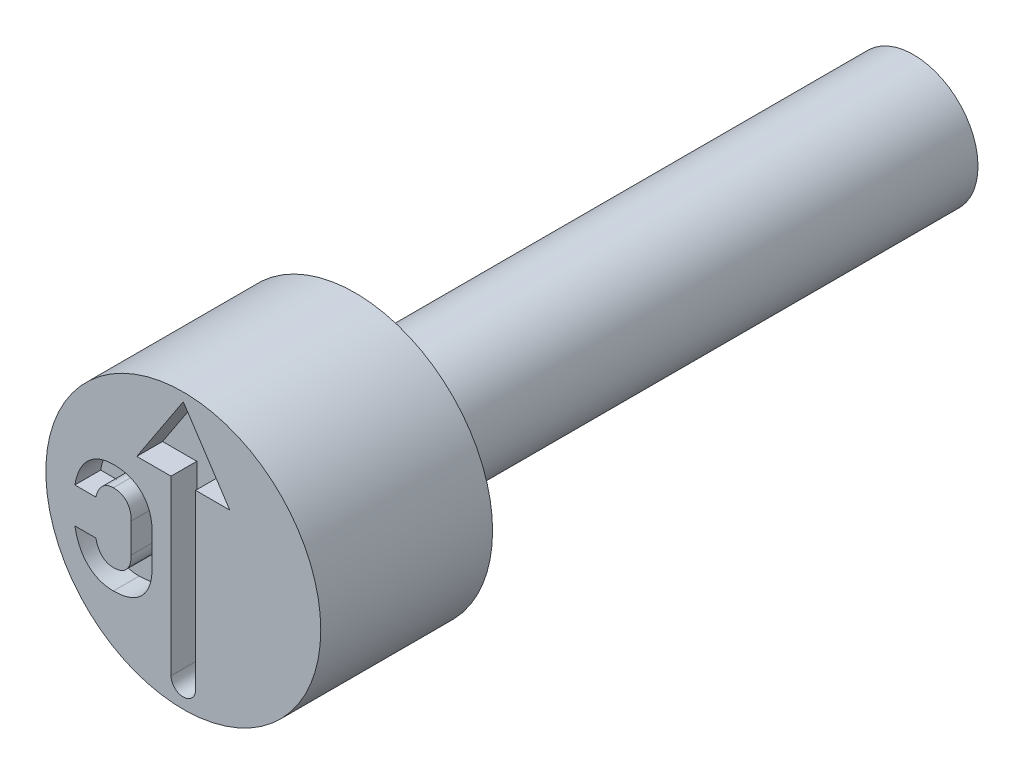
from build123d import *

# Parameters (mm, degrees)
CUT_EXTRUDE4_DEPTH = 0.6
CUT_EXTRUDE5_DEPTH = 0.6


with BuildPart() as part:
    # Sketch2 → Revolve1 (revolve)
    with BuildSketch(Plane(origin=(0, 0, 0), x_dir=(0, 0, -1), z_dir=(1, 0, 0)), mode=Mode.PRIVATE) as revolve1_sk:
        Polygon((0, 3.2), (0, 0), (17, 0), (17, 1.5), (4, 1.5), (4, 3.2), align=None)
    revolve(revolve1_sk.sketch.rotate(Axis((0, 0, -0.403888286), (0, 0, -1)), 90), axis=Axis((0, 0, -0.403888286), (0, 0, -1)))

    # Sketch3 → Cut-Extrude4 (cut)
    with BuildSketch(Plane.XY):
        with BuildLine():
            Line((0.285709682, 1.359527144), (0.285709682, -2.664242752))
            ThreePointArc((0.285709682, -2.664242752), (0, -2.949952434), (-0.285709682, -2.664242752))
            Line((-0.285709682, -2.664242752), (-0.285709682, 1.359527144))
            Line((-0.285709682, 1.359527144), (-1.082876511, 1.359527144))
            Line((-1.082876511, 1.359527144), (0, 3.00317302))
            Line((0, 3.00317302), (1.082876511, 1.359527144))
            Line((1.082876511, 1.359527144), (0.285709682, 1.359527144))
        make_face()
    extrude(amount=-CUT_EXTRUDE4_DEPTH, mode=Mode.SUBTRACT)

    # Sketch4 → Cut-Extrude5 (cut)
    with BuildSketch(Plane.XY):
        with BuildLine():
            add(Edge.make_bspline(
                [(-1.627980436, -1.625983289), (-1.604705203, -1.625731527), (-1.558775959, -1.625234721), (-1.491240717, -1.620065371), (-1.426085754, -1.611424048), (-1.363666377, -1.599238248), (-1.303810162, -1.583865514), (-1.246260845, -1.565695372), (-1.191572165, -1.543201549), (-1.139213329, -1.517693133), (-1.089921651, -1.488821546), (-1.043801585, -1.456347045), (-1.000395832, -1.421288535), (-0.960033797, -1.382943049), (-0.922757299, -1.341534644), (-0.888354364, -1.297017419), (-0.857531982, -1.249107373), (-0.829335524, -1.198450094), (-0.804249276, -1.144907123), (-0.783076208, -1.08822291), (-0.764719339, -1.02902337), (-0.749363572, -0.967317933), (-0.7376066, -0.902826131), (-0.729769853, -0.835596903), (-0.724337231, -0.765566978), (-0.723888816, -0.71793769), (-0.723660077, -0.693641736)],
                knots=[0, 0, 0, 0, 1.134237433, 2.238201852, 3.298772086, 4.336057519, 5.335809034, 6.309558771, 7.274828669, 8.21507465, 9.146315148, 10.055631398, 10.961815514, 11.863452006, 12.765999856, 13.674901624, 14.60241943, 15.539819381, 16.498894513, 17.481225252, 18.486546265, 19.518401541, 20.578551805, 21.679128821, 22.816111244, 24, 24, 24, 24], degree=3))
            Line((-0.723660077, -0.693641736), (-0.723660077, -0.007886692))
            add(Edge.make_bspline(
                [(-0.723660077, -0.007886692), (-0.723888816, 0.016409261), (-0.724337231, 0.064038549), (-0.729769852, 0.134068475), (-0.737606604, 0.201297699), (-0.74936356, 0.265789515), (-0.764719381, 0.327494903), (-0.783076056, 0.386694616), (-0.804249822, 0.443378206), (-0.829333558, 0.496923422), (-0.857539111, 0.547572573), (-0.888328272, 0.59551231), (-0.922929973, 0.640021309), (-0.959852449, 0.681916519), (-1.000418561, 0.720250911), (-1.043800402, 0.755322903), (-1.089903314, 0.787842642), (-1.139355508, 0.816552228), (-1.191412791, 0.842859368), (-1.246384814, 0.864996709), (-1.30369732, 0.884036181), (-1.363683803, 0.89918648), (-1.426080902, 0.911438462), (-1.491242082, 0.920061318), (-1.558775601, 0.925235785), (-1.604705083, 0.925731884), (-1.627980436, 0.925983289)],
                knots=[0, 0, 0, 0, 1.183277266, 2.319672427, 3.419680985, 4.479283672, 5.510605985, 6.515407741, 7.497231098, 8.455810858, 9.392726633, 10.319765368, 11.22819768, 12.136441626, 13.037612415, 13.943328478, 14.852175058, 15.782934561, 16.726365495, 17.691136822, 18.666946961, 19.666182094, 20.70293176, 21.7629542, 22.866348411, 24, 24, 24, 24], degree=3))
            add(Edge.make_bspline(
                [(-1.627980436, 0.925983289), (-1.666282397, 0.924958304), (-1.741363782, 0.922949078), (-1.850488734, 0.902775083), (-1.953538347, 0.8713666), (-2.049910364, 0.826580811), (-2.139303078, 0.770074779), (-2.220669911, 0.701324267), (-2.293983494, 0.621229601), (-2.358610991, 0.52946329), (-2.414736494, 0.427305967), (-2.460941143, 0.314745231), (-2.498445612, 0.192620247), (-2.515091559, 0.106933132), (-2.523639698, 0.062930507)],
                knots=[0, 0, 0, 0, 1.00806925, 1.976066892, 2.912865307, 3.839664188, 4.766819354, 5.690806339, 6.637604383, 7.619531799, 8.640729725, 9.701744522, 10.819784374, 12, 12, 12, 12], degree=3))
            Line((-2.523639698, 0.062930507), (-2.035561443, 0.062930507))
            add(Edge.make_bspline(
                [(-2.035561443, 0.062930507), (-2.030638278, 0.082900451), (-2.021058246, 0.121760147), (-2.001333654, 0.177041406), (-1.978904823, 0.228246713), (-1.951474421, 0.274156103), (-1.921613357, 0.315878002), (-1.887936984, 0.352024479), (-1.851182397, 0.383195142), (-1.811633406, 0.408975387), (-1.76939771, 0.42998585), (-1.724283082, 0.443890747), (-1.676912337, 0.452970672), (-1.644496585, 0.454128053), (-1.627980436, 0.45471775)],
                knots=[0, 0, 0, 0, 1.203096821, 2.341117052, 3.431111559, 4.469295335, 5.465369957, 6.42892467, 7.35290722, 8.279239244, 9.186115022, 10.104036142, 11.033987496, 12, 12, 12, 12], degree=3))
            add(Edge.make_bspline(
                [(-1.627980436, 0.45471775), (-1.606722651, 0.45397355), (-1.565673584, 0.452536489), (-1.506206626, 0.443174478), (-1.452038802, 0.42553799), (-1.402413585, 0.402141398), (-1.358082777, 0.371838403), (-1.319521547, 0.334689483), (-1.286710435, 0.291198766), (-1.259062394, 0.242114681), (-1.237684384, 0.187020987), (-1.222642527, 0.126597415), (-1.213334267, 0.06101077), (-1.212281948, 0.015581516), (-1.211738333, -0.007886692)],
                knots=[0, 0, 0, 0, 1.082677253, 2.090664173, 3.053339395, 3.973921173, 4.875832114, 5.774919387, 6.688160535, 7.640683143, 8.634736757, 9.687648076, 10.805466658, 12, 12, 12, 12], degree=3))
            Line((-1.211738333, -0.007886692), (-1.211738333, -0.693641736))
            add(Edge.make_bspline(
                [(-1.211738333, -0.693641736), (-1.212287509, -0.717108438), (-1.213350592, -0.762534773), (-1.222560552, -0.827978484), (-1.237797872, -0.888176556), (-1.258937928, -0.943026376), (-1.286706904, -0.991745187), (-1.319684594, -1.034726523), (-1.358061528, -1.071866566), (-1.402433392, -1.10208484), (-1.451932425, -1.125721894), (-1.506369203, -1.142337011), (-1.565598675, -1.152766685), (-1.606706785, -1.154052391), (-1.627980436, -1.15471775)],
                knots=[0, 0, 0, 0, 1.196920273, 2.316972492, 3.363591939, 4.359631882, 5.306515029, 6.214703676, 7.115587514, 8.019300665, 8.94172196, 9.903709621, 10.915159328, 12, 12, 12, 12], degree=3))
            add(Edge.make_bspline(
                [(-1.627980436, -1.15471775), (-1.644819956, -1.154054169), (-1.677848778, -1.152752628), (-1.726100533, -1.144784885), (-1.771531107, -1.130100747), (-1.814447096, -1.110315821), (-1.854533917, -1.084754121), (-1.890648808, -1.053171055), (-1.924287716, -1.01722018), (-1.95422742, -0.975731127), (-1.98076781, -0.929302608), (-2.002962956, -0.877916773), (-2.022229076, -0.822145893), (-2.031026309, -0.782737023), (-2.035561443, -0.762421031)],
                knots=[0, 0, 0, 0, 0.981077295, 1.924272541, 2.837745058, 3.753838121, 4.670304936, 5.59622504, 6.54113043, 7.532377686, 8.569122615, 9.649813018, 10.788435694, 12, 12, 12, 12], degree=3))
            Line((-2.035561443, -0.762421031), (-2.523639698, -0.762421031))
            add(Edge.make_bspline(
                [(-2.523639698, -0.762421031), (-2.514932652, -0.806597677), (-2.49800457, -0.892485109), (-2.459964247, -1.014794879), (-2.413086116, -1.127170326), (-2.357298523, -1.229442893), (-2.292261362, -1.320601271), (-2.219530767, -1.400986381), (-2.13849212, -1.46991987), (-2.049312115, -1.526709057), (-1.953018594, -1.571354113), (-1.850138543, -1.602707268), (-1.741202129, -1.62299117), (-1.666284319, -1.624971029), (-1.627980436, -1.625983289)],
                knots=[0, 0, 0, 0, 1.185884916, 2.305575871, 3.368634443, 4.390138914, 5.368714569, 6.312778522, 7.23993122, 8.163588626, 9.090665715, 10.027745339, 10.991628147, 12, 12, 12, 12], degree=3))
        make_face()
    extrude(amount=-CUT_EXTRUDE5_DEPTH, mode=Mode.SUBTRACT)


solid = part.part
